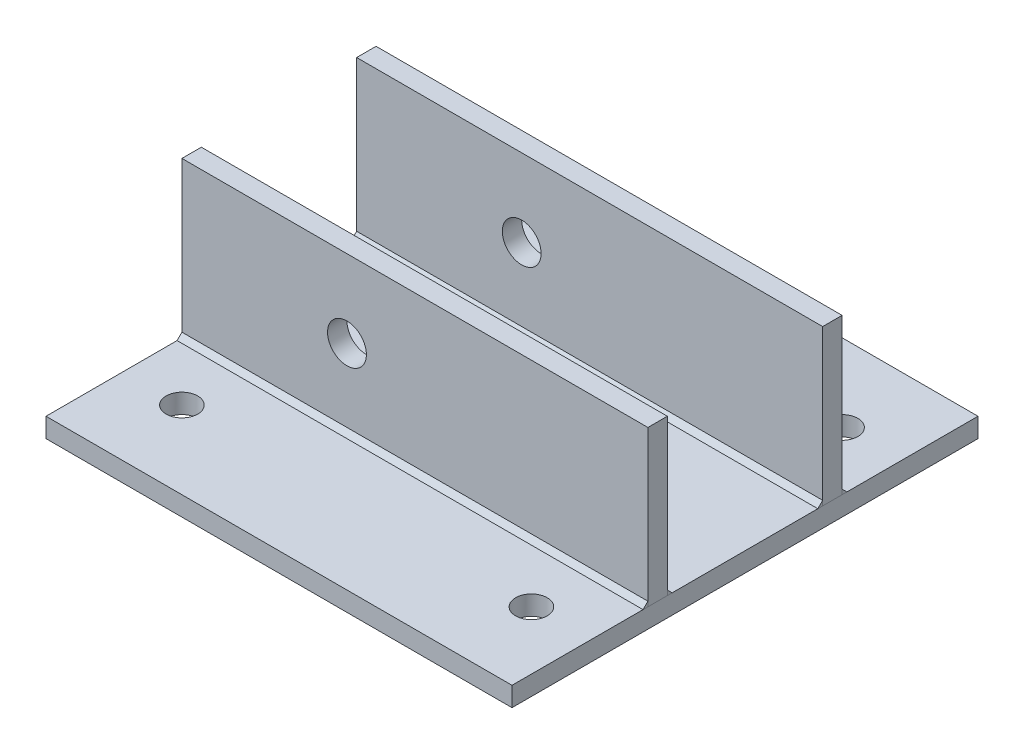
ISO-10303-21;
HEADER;
FILE_DESCRIPTION(('STEP AP214'),'2;1');
FILE_NAME('part.step','',(''),(''),'','','');
FILE_SCHEMA(('AUTOMOTIVE_DESIGN { 1 0 10303 214 1 1 1 1 }'));
ENDSEC;
DATA;
#1=APPLICATION_CONTEXT('core data for automotive mechanical design processes');
#2=APPLICATION_PROTOCOL_DEFINITION('international standard','automotive_design',2000,#1);
#3=PRODUCT_CONTEXT('',#1,'mechanical');
#4=PRODUCT('Part','Part','',(#3));
#5=PRODUCT_RELATED_PRODUCT_CATEGORY('part','',(#4));
#6=PRODUCT_DEFINITION_FORMATION('','',#4);
#7=PRODUCT_DEFINITION_CONTEXT('part definition',#1,'design');
#8=PRODUCT_DEFINITION('design','',#6,#7);
#9=PRODUCT_DEFINITION_SHAPE('','',#8);
#10=(LENGTH_UNIT() NAMED_UNIT(*) SI_UNIT(.MILLI.,.METRE.));
#11=(NAMED_UNIT(*) PLANE_ANGLE_UNIT() SI_UNIT($,.RADIAN.));
#12=(NAMED_UNIT(*) SI_UNIT($,.STERADIAN.) SOLID_ANGLE_UNIT());
#13=UNCERTAINTY_MEASURE_WITH_UNIT(LENGTH_MEASURE(1.E-05),#10,'distance_accuracy_value','');
#14=(GEOMETRIC_REPRESENTATION_CONTEXT(3) GLOBAL_UNCERTAINTY_ASSIGNED_CONTEXT((#13)) GLOBAL_UNIT_ASSIGNED_CONTEXT((#10,
#11,#12)) REPRESENTATION_CONTEXT('',''));
#15=CARTESIAN_POINT('',(0.,0.,0.));
#16=DIRECTION('',(0.,0.,1.));
#17=DIRECTION('',(1.,0.,0.));
#18=AXIS2_PLACEMENT_3D('',#15,#16,#17);
#19=CARTESIAN_POINT('',(0.,12.7,0.));
#20=DIRECTION('',(-1.,0.,0.));
#21=DIRECTION('',(0.,0.,1.));
#22=AXIS2_PLACEMENT_3D('',#19,#20,#21);
#23=PLANE('',#22);
#24=DIRECTION('',(0.,0.,-1.));
#25=VECTOR('',#24,1.);
#26=CARTESIAN_POINT('',(0.,12.7,304.8));
#27=LINE('',#26,#25);
#28=CARTESIAN_POINT('',(0.,12.7,203.2));
#29=VERTEX_POINT('',#28);
#30=CARTESIAN_POINT('',(0.,12.7,200.025));
#31=VERTEX_POINT('',#30);
#32=EDGE_CURVE('E48',#29,#31,#27,.T.);
#33=ORIENTED_EDGE('',*,*,#32,.T.);
#34=DIRECTION('',(0.,-0.707106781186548,-0.707106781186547));
#35=VECTOR('',#34,1.);
#36=CARTESIAN_POINT('',(0.,-87.3125,100.0125));
#37=LINE('',#36,#35);
#38=CARTESIAN_POINT('',(0.,15.875,203.2));
#39=VERTEX_POINT('',#38);
#40=EDGE_CURVE('E94',#31,#39,#37,.F.);
#41=ORIENTED_EDGE('',*,*,#40,.T.);
#42=DIRECTION('',(0.,-1.,0.));
#43=VECTOR('',#42,1.);
#44=CARTESIAN_POINT('',(0.,114.3,203.2));
#45=LINE('',#44,#43);
#46=EDGE_CURVE('E63',#39,#29,#45,.T.);
#47=ORIENTED_EDGE('',*,*,#46,.T.);
#48=EDGE_LOOP('',(#33,#41,#47));
#49=FACE_BOUND('',#48,.T.);
#50=ADVANCED_FACE('F44',(#49),#23,.F.);
#51=CARTESIAN_POINT('',(-304.8,12.7,0.));
#52=DIRECTION('',(1.,0.,0.));
#53=DIRECTION('',(0.,0.,-1.));
#54=AXIS2_PLACEMENT_3D('',#51,#52,#53);
#55=PLANE('',#54);
#56=DIRECTION('',(0.,0.,1.));
#57=VECTOR('',#56,1.);
#58=CARTESIAN_POINT('',(-304.8,12.7,304.8));
#59=LINE('',#58,#57);
#60=CARTESIAN_POINT('',(-304.8,12.7,200.025));
#61=VERTEX_POINT('',#60);
#62=CARTESIAN_POINT('',(-304.8,12.7,203.2));
#63=VERTEX_POINT('',#62);
#64=EDGE_CURVE('E81',#61,#63,#59,.T.);
#65=ORIENTED_EDGE('',*,*,#64,.T.);
#66=DIRECTION('',(0.,-1.,0.));
#67=VECTOR('',#66,1.);
#68=CARTESIAN_POINT('',(-304.8,114.3,203.2));
#69=LINE('',#68,#67);
#70=CARTESIAN_POINT('',(-304.8,15.875,203.2));
#71=VERTEX_POINT('',#70);
#72=EDGE_CURVE('E12',#71,#63,#69,.T.);
#73=ORIENTED_EDGE('',*,*,#72,.F.);
#74=DIRECTION('',(0.,0.707106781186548,0.707106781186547));
#75=VECTOR('',#74,1.);
#76=CARTESIAN_POINT('',(-304.8,-87.3125,100.0125));
#77=LINE('',#76,#75);
#78=EDGE_CURVE('E84',#71,#61,#77,.F.);
#79=ORIENTED_EDGE('',*,*,#78,.T.);
#80=EDGE_LOOP('',(#65,#73,#79));
#81=FACE_BOUND('',#80,.T.);
#82=ADVANCED_FACE('F82',(#81),#55,.F.);
#83=CARTESIAN_POINT('',(-304.8,15.875,203.2));
#84=DIRECTION('',(0.,0.707106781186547,-0.707106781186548));
#85=DIRECTION('',(0.,0.707106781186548,0.707106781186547));
#86=AXIS2_PLACEMENT_3D('',#83,#84,#85);
#87=PLANE('',#86);
#88=ORIENTED_EDGE('',*,*,#40,.F.);
#89=DIRECTION('',(1.,0.,0.));
#90=VECTOR('',#89,1.);
#91=CARTESIAN_POINT('',(0.,12.7,200.025));
#92=LINE('',#91,#90);
#93=EDGE_CURVE('E89',#61,#31,#92,.T.);
#94=ORIENTED_EDGE('',*,*,#93,.F.);
#95=ORIENTED_EDGE('',*,*,#78,.F.);
#96=DIRECTION('',(-1.,0.,0.));
#97=VECTOR('',#96,1.);
#98=CARTESIAN_POINT('',(-304.8,15.875,203.2));
#99=LINE('',#98,#97);
#100=EDGE_CURVE('E54',#39,#71,#99,.T.);
#101=ORIENTED_EDGE('',*,*,#100,.F.);
#102=EDGE_LOOP('',(#88,#94,#95,#101));
#103=FACE_BOUND('',#102,.T.);
#104=ADVANCED_FACE('F100',(#103),#87,.T.);
#105=CARTESIAN_POINT('',(0.,12.7,304.8));
#106=DIRECTION('',(0.,-1.,0.));
#107=DIRECTION('',(0.,0.,-1.));
#108=AXIS2_PLACEMENT_3D('',#105,#106,#107);
#109=PLANE('',#108);
#110=ORIENTED_EDGE('',*,*,#93,.T.);
#111=ORIENTED_EDGE('',*,*,#32,.F.);
#112=DIRECTION('',(-1.,0.,0.));
#113=VECTOR('',#112,1.);
#114=CARTESIAN_POINT('',(0.,12.7,203.2));
#115=LINE('',#114,#113);
#116=EDGE_CURVE('E87',#29,#63,#115,.T.);
#117=ORIENTED_EDGE('',*,*,#116,.T.);
#118=ORIENTED_EDGE('',*,*,#64,.F.);
#119=EDGE_LOOP('',(#110,#111,#117,#118));
#120=FACE_BOUND('',#119,.T.);
#121=ADVANCED_FACE('F46',(#120),#109,.T.);
#122=CARTESIAN_POINT('',(-304.8,114.3,203.2));
#123=DIRECTION('',(0.,0.,1.));
#124=DIRECTION('',(1.,0.,0.));
#125=AXIS2_PLACEMENT_3D('',#122,#123,#124);
#126=PLANE('',#125);
#127=ORIENTED_EDGE('',*,*,#100,.T.);
#128=ORIENTED_EDGE('',*,*,#72,.T.);
#129=ORIENTED_EDGE('',*,*,#116,.F.);
#130=ORIENTED_EDGE('',*,*,#46,.F.);
#131=EDGE_LOOP('',(#127,#128,#129,#130));
#132=FACE_BOUND('',#131,.T.);
#133=ADVANCED_FACE('F86',(#132),#126,.T.);
#134=CLOSED_SHELL('',(#50,#82,#104,#121,#133));
#135=MANIFOLD_SOLID_BREP('B2',#134);
#136=CARTESIAN_POINT('',(-304.8,15.875,215.9));
#137=DIRECTION('',(0.,0.707106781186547,0.707106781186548));
#138=DIRECTION('',(0.,-0.707106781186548,0.707106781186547));
#139=AXIS2_PLACEMENT_3D('',#136,#137,#138);
#140=PLANE('',#139);
#141=DIRECTION('',(0.,-0.707106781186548,0.707106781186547));
#142=VECTOR('',#141,1.);
#143=CARTESIAN_POINT('',(-304.8,122.2375,109.5375));
#144=LINE('',#143,#142);
#145=CARTESIAN_POINT('',(-304.8,12.7,219.075));
#146=VERTEX_POINT('',#145);
#147=CARTESIAN_POINT('',(-304.8,15.875,215.9));
#148=VERTEX_POINT('',#147);
#149=EDGE_CURVE('E42',#146,#148,#144,.F.);
#150=ORIENTED_EDGE('',*,*,#149,.F.);
#151=DIRECTION('',(-1.,0.,0.));
#152=VECTOR('',#151,1.);
#153=CARTESIAN_POINT('',(-304.8,12.7,219.075));
#154=LINE('',#153,#152);
#155=CARTESIAN_POINT('',(0.,12.7,219.075));
#156=VERTEX_POINT('',#155);
#157=EDGE_CURVE('E200',#156,#146,#154,.T.);
#158=ORIENTED_EDGE('',*,*,#157,.F.);
#159=DIRECTION('',(0.,0.707106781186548,-0.707106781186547));
#160=VECTOR('',#159,1.);
#161=CARTESIAN_POINT('',(0.,122.2375,109.5375));
#162=LINE('',#161,#160);
#163=CARTESIAN_POINT('',(0.,15.875,215.9));
#164=VERTEX_POINT('',#163);
#165=EDGE_CURVE('E159',#164,#156,#162,.F.);
#166=ORIENTED_EDGE('',*,*,#165,.F.);
#167=DIRECTION('',(1.,0.,0.));
#168=VECTOR('',#167,1.);
#169=CARTESIAN_POINT('',(0.,15.875,215.9));
#170=LINE('',#169,#168);
#171=EDGE_CURVE('E198',#148,#164,#170,.T.);
#172=ORIENTED_EDGE('',*,*,#171,.F.);
#173=EDGE_LOOP('',(#150,#158,#166,#172));
#174=FACE_BOUND('',#173,.T.);
#175=ADVANCED_FACE('F152',(#174),#140,.T.);
#176=CARTESIAN_POINT('',(-304.8,12.7,0.));
#177=DIRECTION('',(1.,0.,0.));
#178=DIRECTION('',(0.,0.,-1.));
#179=AXIS2_PLACEMENT_3D('',#176,#177,#178);
#180=PLANE('',#179);
#181=DIRECTION('',(0.,0.,1.));
#182=VECTOR('',#181,1.);
#183=CARTESIAN_POINT('',(-304.8,12.7,304.8));
#184=LINE('',#183,#182);
#185=CARTESIAN_POINT('',(-304.8,12.7,215.9));
#186=VERTEX_POINT('',#185);
#187=EDGE_CURVE('E190',#186,#146,#184,.T.);
#188=ORIENTED_EDGE('',*,*,#187,.T.);
#189=ORIENTED_EDGE('',*,*,#149,.T.);
#190=DIRECTION('',(0.,-1.,0.));
#191=VECTOR('',#190,1.);
#192=CARTESIAN_POINT('',(-304.8,114.3,215.9));
#193=LINE('',#192,#191);
#194=EDGE_CURVE('E166',#148,#186,#193,.T.);
#195=ORIENTED_EDGE('',*,*,#194,.T.);
#196=EDGE_LOOP('',(#188,#189,#195));
#197=FACE_BOUND('',#196,.T.);
#198=ADVANCED_FACE('F208',(#197),#180,.F.);
#199=CARTESIAN_POINT('',(0.,12.7,0.));
#200=DIRECTION('',(-1.,0.,0.));
#201=DIRECTION('',(0.,0.,1.));
#202=AXIS2_PLACEMENT_3D('',#199,#200,#201);
#203=PLANE('',#202);
#204=DIRECTION('',(0.,0.,-1.));
#205=VECTOR('',#204,1.);
#206=CARTESIAN_POINT('',(0.,12.7,304.8));
#207=LINE('',#206,#205);
#208=CARTESIAN_POINT('',(0.,12.7,215.9));
#209=VERTEX_POINT('',#208);
#210=EDGE_CURVE('E173',#156,#209,#207,.T.);
#211=ORIENTED_EDGE('',*,*,#210,.T.);
#212=DIRECTION('',(0.,-1.,0.));
#213=VECTOR('',#212,1.);
#214=CARTESIAN_POINT('',(0.,12.7,215.9));
#215=LINE('',#214,#213);
#216=EDGE_CURVE('E187',#164,#209,#215,.T.);
#217=ORIENTED_EDGE('',*,*,#216,.F.);
#218=ORIENTED_EDGE('',*,*,#165,.T.);
#219=EDGE_LOOP('',(#211,#217,#218));
#220=FACE_BOUND('',#219,.T.);
#221=ADVANCED_FACE('F185',(#220),#203,.F.);
#222=CARTESIAN_POINT('',(-304.8,114.3,215.9));
#223=DIRECTION('',(0.,0.,-1.));
#224=DIRECTION('',(-1.,0.,0.));
#225=AXIS2_PLACEMENT_3D('',#222,#223,#224);
#226=PLANE('',#225);
#227=ORIENTED_EDGE('',*,*,#171,.T.);
#228=ORIENTED_EDGE('',*,*,#216,.T.);
#229=DIRECTION('',(1.,0.,0.));
#230=VECTOR('',#229,1.);
#231=CARTESIAN_POINT('',(0.,12.7,215.9));
#232=LINE('',#231,#230);
#233=EDGE_CURVE('E192',#186,#209,#232,.T.);
#234=ORIENTED_EDGE('',*,*,#233,.F.);
#235=ORIENTED_EDGE('',*,*,#194,.F.);
#236=EDGE_LOOP('',(#227,#228,#234,#235));
#237=FACE_BOUND('',#236,.T.);
#238=ADVANCED_FACE('F196',(#237),#226,.T.);
#239=CARTESIAN_POINT('',(0.,12.7,304.8));
#240=DIRECTION('',(0.,-1.,0.));
#241=DIRECTION('',(0.,0.,-1.));
#242=AXIS2_PLACEMENT_3D('',#239,#240,#241);
#243=PLANE('',#242);
#244=ORIENTED_EDGE('',*,*,#157,.T.);
#245=ORIENTED_EDGE('',*,*,#187,.F.);
#246=ORIENTED_EDGE('',*,*,#233,.T.);
#247=ORIENTED_EDGE('',*,*,#210,.F.);
#248=EDGE_LOOP('',(#244,#245,#246,#247));
#249=FACE_BOUND('',#248,.T.);
#250=ADVANCED_FACE('F193',(#249),#243,.T.);
#251=CLOSED_SHELL('',(#175,#198,#221,#238,#250));
#252=MANIFOLD_SOLID_BREP('B6',#251);
#253=CARTESIAN_POINT('',(0.,12.7,0.));
#254=DIRECTION('',(-1.,0.,0.));
#255=DIRECTION('',(0.,0.,1.));
#256=AXIS2_PLACEMENT_3D('',#253,#254,#255);
#257=PLANE('',#256);
#258=DIRECTION('',(0.,0.,-1.));
#259=VECTOR('',#258,1.);
#260=CARTESIAN_POINT('',(0.,12.7,304.8));
#261=LINE('',#260,#259);
#262=CARTESIAN_POINT('',(0.,12.7,88.9));
#263=VERTEX_POINT('',#262);
#264=CARTESIAN_POINT('',(0.,12.7,85.725));
#265=VERTEX_POINT('',#264);
#266=EDGE_CURVE('E264',#263,#265,#261,.T.);
#267=ORIENTED_EDGE('',*,*,#266,.T.);
#268=DIRECTION('',(0.,-0.707106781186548,-0.707106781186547));
#269=VECTOR('',#268,1.);
#270=CARTESIAN_POINT('',(0.,-30.1625,42.8625));
#271=LINE('',#270,#269);
#272=CARTESIAN_POINT('',(0.,15.875,88.9));
#273=VERTEX_POINT('',#272);
#274=EDGE_CURVE('E310',#265,#273,#271,.F.);
#275=ORIENTED_EDGE('',*,*,#274,.T.);
#276=DIRECTION('',(0.,-1.,0.));
#277=VECTOR('',#276,1.);
#278=CARTESIAN_POINT('',(0.,114.3,88.9));
#279=LINE('',#278,#277);
#280=EDGE_CURVE('E279',#273,#263,#279,.T.);
#281=ORIENTED_EDGE('',*,*,#280,.T.);
#282=EDGE_LOOP('',(#267,#275,#281));
#283=FACE_BOUND('',#282,.T.);
#284=ADVANCED_FACE('F260',(#283),#257,.F.);
#285=CARTESIAN_POINT('',(-304.8,12.7,0.));
#286=DIRECTION('',(1.,0.,0.));
#287=DIRECTION('',(0.,0.,-1.));
#288=AXIS2_PLACEMENT_3D('',#285,#286,#287);
#289=PLANE('',#288);
#290=DIRECTION('',(0.,0.,1.));
#291=VECTOR('',#290,1.);
#292=CARTESIAN_POINT('',(-304.8,12.7,304.8));
#293=LINE('',#292,#291);
#294=CARTESIAN_POINT('',(-304.8,12.7,85.725));
#295=VERTEX_POINT('',#294);
#296=CARTESIAN_POINT('',(-304.8,12.7,88.9));
#297=VERTEX_POINT('',#296);
#298=EDGE_CURVE('E297',#295,#297,#293,.T.);
#299=ORIENTED_EDGE('',*,*,#298,.T.);
#300=DIRECTION('',(0.,-1.,0.));
#301=VECTOR('',#300,1.);
#302=CARTESIAN_POINT('',(-304.8,114.3,88.9));
#303=LINE('',#302,#301);
#304=CARTESIAN_POINT('',(-304.8,15.875,88.9));
#305=VERTEX_POINT('',#304);
#306=EDGE_CURVE('E150',#305,#297,#303,.T.);
#307=ORIENTED_EDGE('',*,*,#306,.F.);
#308=DIRECTION('',(0.,0.707106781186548,0.707106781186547));
#309=VECTOR('',#308,1.);
#310=CARTESIAN_POINT('',(-304.8,-30.1625,42.8625));
#311=LINE('',#310,#309);
#312=EDGE_CURVE('E300',#305,#295,#311,.F.);
#313=ORIENTED_EDGE('',*,*,#312,.T.);
#314=EDGE_LOOP('',(#299,#307,#313));
#315=FACE_BOUND('',#314,.T.);
#316=ADVANCED_FACE('F298',(#315),#289,.F.);
#317=CARTESIAN_POINT('',(-304.8,15.875,88.9));
#318=DIRECTION('',(0.,0.707106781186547,-0.707106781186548));
#319=DIRECTION('',(0.,0.707106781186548,0.707106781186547));
#320=AXIS2_PLACEMENT_3D('',#317,#318,#319);
#321=PLANE('',#320);
#322=ORIENTED_EDGE('',*,*,#274,.F.);
#323=DIRECTION('',(1.,0.,0.));
#324=VECTOR('',#323,1.);
#325=CARTESIAN_POINT('',(0.,12.7,85.725));
#326=LINE('',#325,#324);
#327=EDGE_CURVE('E305',#295,#265,#326,.T.);
#328=ORIENTED_EDGE('',*,*,#327,.F.);
#329=ORIENTED_EDGE('',*,*,#312,.F.);
#330=DIRECTION('',(-1.,0.,0.));
#331=VECTOR('',#330,1.);
#332=CARTESIAN_POINT('',(-304.8,15.875,88.9));
#333=LINE('',#332,#331);
#334=EDGE_CURVE('E270',#273,#305,#333,.T.);
#335=ORIENTED_EDGE('',*,*,#334,.F.);
#336=EDGE_LOOP('',(#322,#328,#329,#335));
#337=FACE_BOUND('',#336,.T.);
#338=ADVANCED_FACE('F316',(#337),#321,.T.);
#339=CARTESIAN_POINT('',(0.,12.7,304.8));
#340=DIRECTION('',(0.,-1.,0.));
#341=DIRECTION('',(0.,0.,-1.));
#342=AXIS2_PLACEMENT_3D('',#339,#340,#341);
#343=PLANE('',#342);
#344=ORIENTED_EDGE('',*,*,#327,.T.);
#345=ORIENTED_EDGE('',*,*,#266,.F.);
#346=DIRECTION('',(-1.,0.,0.));
#347=VECTOR('',#346,1.);
#348=CARTESIAN_POINT('',(0.,12.7,88.9));
#349=LINE('',#348,#347);
#350=EDGE_CURVE('E303',#263,#297,#349,.T.);
#351=ORIENTED_EDGE('',*,*,#350,.T.);
#352=ORIENTED_EDGE('',*,*,#298,.F.);
#353=EDGE_LOOP('',(#344,#345,#351,#352));
#354=FACE_BOUND('',#353,.T.);
#355=ADVANCED_FACE('F262',(#354),#343,.T.);
#356=CARTESIAN_POINT('',(-304.8,114.3,88.9));
#357=DIRECTION('',(0.,0.,1.));
#358=DIRECTION('',(1.,0.,0.));
#359=AXIS2_PLACEMENT_3D('',#356,#357,#358);
#360=PLANE('',#359);
#361=ORIENTED_EDGE('',*,*,#334,.T.);
#362=ORIENTED_EDGE('',*,*,#306,.T.);
#363=ORIENTED_EDGE('',*,*,#350,.F.);
#364=ORIENTED_EDGE('',*,*,#280,.F.);
#365=EDGE_LOOP('',(#361,#362,#363,#364));
#366=FACE_BOUND('',#365,.T.);
#367=ADVANCED_FACE('F302',(#366),#360,.T.);
#368=CLOSED_SHELL('',(#284,#316,#338,#355,#367));
#369=MANIFOLD_SOLID_BREP('B36',#368);
#370=CARTESIAN_POINT('',(-304.8,15.875,101.6));
#371=DIRECTION('',(0.,0.707106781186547,0.707106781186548));
#372=DIRECTION('',(0.,-0.707106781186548,0.707106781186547));
#373=AXIS2_PLACEMENT_3D('',#370,#371,#372);
#374=PLANE('',#373);
#375=DIRECTION('',(0.,-0.707106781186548,0.707106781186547));
#376=VECTOR('',#375,1.);
#377=CARTESIAN_POINT('',(-304.8,65.0875,52.3875));
#378=LINE('',#377,#376);
#379=CARTESIAN_POINT('',(-304.8,12.7,104.775));
#380=VERTEX_POINT('',#379);
#381=CARTESIAN_POINT('',(-304.8,15.875,101.6));
#382=VERTEX_POINT('',#381);
#383=EDGE_CURVE('E258',#380,#382,#378,.F.);
#384=ORIENTED_EDGE('',*,*,#383,.F.);
#385=DIRECTION('',(-1.,0.,0.));
#386=VECTOR('',#385,1.);
#387=CARTESIAN_POINT('',(-304.8,12.7,104.775));
#388=LINE('',#387,#386);
#389=CARTESIAN_POINT('',(0.,12.7,104.775));
#390=VERTEX_POINT('',#389);
#391=EDGE_CURVE('E416',#390,#380,#388,.T.);
#392=ORIENTED_EDGE('',*,*,#391,.F.);
#393=DIRECTION('',(0.,0.707106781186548,-0.707106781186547));
#394=VECTOR('',#393,1.);
#395=CARTESIAN_POINT('',(0.,65.0875,52.3875));
#396=LINE('',#395,#394);
#397=CARTESIAN_POINT('',(0.,15.875,101.6));
#398=VERTEX_POINT('',#397);
#399=EDGE_CURVE('E375',#398,#390,#396,.F.);
#400=ORIENTED_EDGE('',*,*,#399,.F.);
#401=DIRECTION('',(1.,0.,0.));
#402=VECTOR('',#401,1.);
#403=CARTESIAN_POINT('',(0.,15.875,101.6));
#404=LINE('',#403,#402);
#405=EDGE_CURVE('E414',#382,#398,#404,.T.);
#406=ORIENTED_EDGE('',*,*,#405,.F.);
#407=EDGE_LOOP('',(#384,#392,#400,#406));
#408=FACE_BOUND('',#407,.T.);
#409=ADVANCED_FACE('F368',(#408),#374,.T.);
#410=CARTESIAN_POINT('',(-304.8,12.7,0.));
#411=DIRECTION('',(1.,0.,0.));
#412=DIRECTION('',(0.,0.,-1.));
#413=AXIS2_PLACEMENT_3D('',#410,#411,#412);
#414=PLANE('',#413);
#415=DIRECTION('',(0.,0.,1.));
#416=VECTOR('',#415,1.);
#417=CARTESIAN_POINT('',(-304.8,12.7,304.8));
#418=LINE('',#417,#416);
#419=CARTESIAN_POINT('',(-304.8,12.7,101.6));
#420=VERTEX_POINT('',#419);
#421=EDGE_CURVE('E406',#420,#380,#418,.T.);
#422=ORIENTED_EDGE('',*,*,#421,.T.);
#423=ORIENTED_EDGE('',*,*,#383,.T.);
#424=DIRECTION('',(0.,-1.,0.));
#425=VECTOR('',#424,1.);
#426=CARTESIAN_POINT('',(-304.8,114.3,101.6));
#427=LINE('',#426,#425);
#428=EDGE_CURVE('E382',#382,#420,#427,.T.);
#429=ORIENTED_EDGE('',*,*,#428,.T.);
#430=EDGE_LOOP('',(#422,#423,#429));
#431=FACE_BOUND('',#430,.T.);
#432=ADVANCED_FACE('F424',(#431),#414,.F.);
#433=CARTESIAN_POINT('',(0.,12.7,0.));
#434=DIRECTION('',(-1.,0.,0.));
#435=DIRECTION('',(0.,0.,1.));
#436=AXIS2_PLACEMENT_3D('',#433,#434,#435);
#437=PLANE('',#436);
#438=DIRECTION('',(0.,0.,-1.));
#439=VECTOR('',#438,1.);
#440=CARTESIAN_POINT('',(0.,12.7,304.8));
#441=LINE('',#440,#439);
#442=CARTESIAN_POINT('',(0.,12.7,101.6));
#443=VERTEX_POINT('',#442);
#444=EDGE_CURVE('E389',#390,#443,#441,.T.);
#445=ORIENTED_EDGE('',*,*,#444,.T.);
#446=DIRECTION('',(0.,-1.,0.));
#447=VECTOR('',#446,1.);
#448=CARTESIAN_POINT('',(0.,12.7,101.6));
#449=LINE('',#448,#447);
#450=EDGE_CURVE('E403',#398,#443,#449,.T.);
#451=ORIENTED_EDGE('',*,*,#450,.F.);
#452=ORIENTED_EDGE('',*,*,#399,.T.);
#453=EDGE_LOOP('',(#445,#451,#452));
#454=FACE_BOUND('',#453,.T.);
#455=ADVANCED_FACE('F401',(#454),#437,.F.);
#456=CARTESIAN_POINT('',(-304.8,114.3,101.6));
#457=DIRECTION('',(0.,0.,-1.));
#458=DIRECTION('',(-1.,0.,0.));
#459=AXIS2_PLACEMENT_3D('',#456,#457,#458);
#460=PLANE('',#459);
#461=ORIENTED_EDGE('',*,*,#405,.T.);
#462=ORIENTED_EDGE('',*,*,#450,.T.);
#463=DIRECTION('',(1.,0.,0.));
#464=VECTOR('',#463,1.);
#465=CARTESIAN_POINT('',(0.,12.7,101.6));
#466=LINE('',#465,#464);
#467=EDGE_CURVE('E408',#420,#443,#466,.T.);
#468=ORIENTED_EDGE('',*,*,#467,.F.);
#469=ORIENTED_EDGE('',*,*,#428,.F.);
#470=EDGE_LOOP('',(#461,#462,#468,#469));
#471=FACE_BOUND('',#470,.T.);
#472=ADVANCED_FACE('F412',(#471),#460,.T.);
#473=CARTESIAN_POINT('',(0.,12.7,304.8));
#474=DIRECTION('',(0.,-1.,0.));
#475=DIRECTION('',(0.,0.,-1.));
#476=AXIS2_PLACEMENT_3D('',#473,#474,#475);
#477=PLANE('',#476);
#478=ORIENTED_EDGE('',*,*,#391,.T.);
#479=ORIENTED_EDGE('',*,*,#421,.F.);
#480=ORIENTED_EDGE('',*,*,#467,.T.);
#481=ORIENTED_EDGE('',*,*,#444,.F.);
#482=EDGE_LOOP('',(#478,#479,#480,#481));
#483=FACE_BOUND('',#482,.T.);
#484=ADVANCED_FACE('F409',(#483),#477,.T.);
#485=CLOSED_SHELL('',(#409,#432,#455,#472,#484));
#486=MANIFOLD_SOLID_BREP('B144',#485);
#487=CARTESIAN_POINT('',(-304.8,114.3,203.2));
#488=DIRECTION('',(1.,0.,0.));
#489=DIRECTION('',(0.,0.,-1.));
#490=AXIS2_PLACEMENT_3D('',#487,#488,#489);
#491=PLANE('',#490);
#492=DIRECTION('',(0.,0.,1.));
#493=VECTOR('',#492,1.);
#494=CARTESIAN_POINT('',(-304.8,12.7,203.2));
#495=LINE('',#494,#493);
#496=CARTESIAN_POINT('',(-304.8,12.7,203.2));
#497=VERTEX_POINT('',#496);
#498=CARTESIAN_POINT('',(-304.8,12.7,215.9));
#499=VERTEX_POINT('',#498);
#500=EDGE_CURVE('E541',#497,#499,#495,.T.);
#501=ORIENTED_EDGE('',*,*,#500,.T.);
#502=DIRECTION('',(0.,-1.,0.));
#503=VECTOR('',#502,1.);
#504=CARTESIAN_POINT('',(-304.8,114.3,215.9));
#505=LINE('',#504,#503);
#506=CARTESIAN_POINT('',(-304.8,114.3,215.9));
#507=VERTEX_POINT('',#506);
#508=EDGE_CURVE('E366',#507,#499,#505,.T.);
#509=ORIENTED_EDGE('',*,*,#508,.F.);
#510=DIRECTION('',(0.,0.,1.));
#511=VECTOR('',#510,1.);
#512=CARTESIAN_POINT('',(-304.8,114.3,203.2));
#513=LINE('',#512,#511);
#514=CARTESIAN_POINT('',(-304.8,114.3,203.2));
#515=VERTEX_POINT('',#514);
#516=EDGE_CURVE('E528',#515,#507,#513,.T.);
#517=ORIENTED_EDGE('',*,*,#516,.F.);
#518=DIRECTION('',(0.,-1.,0.));
#519=VECTOR('',#518,1.);
#520=CARTESIAN_POINT('',(-304.8,114.3,203.2));
#521=LINE('',#520,#519);
#522=EDGE_CURVE('E537',#515,#497,#521,.T.);
#523=ORIENTED_EDGE('',*,*,#522,.T.);
#524=EDGE_LOOP('',(#501,#509,#517,#523));
#525=FACE_BOUND('',#524,.T.);
#526=ADVANCED_FACE('F476',(#525),#491,.F.);
#527=CARTESIAN_POINT('',(-304.8,114.3,215.9));
#528=DIRECTION('',(0.,0.,-1.));
#529=DIRECTION('',(-1.,0.,0.));
#530=AXIS2_PLACEMENT_3D('',#527,#528,#529);
#531=PLANE('',#530);
#532=CARTESIAN_POINT('',(-196.85,63.5,215.9));
#533=DIRECTION('',(0.,0.,1.));
#534=DIRECTION('',(1.,0.,0.));
#535=AXIS2_PLACEMENT_3D('',#532,#533,#534);
#536=CIRCLE('',#535,12.7);
#537=CARTESIAN_POINT('',(-184.15,63.5,215.9));
#538=VERTEX_POINT('',#537);
#539=EDGE_CURVE('E554',#538,#538,#536,.T.);
#540=ORIENTED_EDGE('',*,*,#539,.F.);
#541=EDGE_LOOP('',(#540));
#542=FACE_BOUND('',#541,.T.);
#543=DIRECTION('',(1.,0.,0.));
#544=VECTOR('',#543,1.);
#545=CARTESIAN_POINT('',(-304.8,12.7,215.9));
#546=LINE('',#545,#544);
#547=CARTESIAN_POINT('',(0.,12.7,215.9));
#548=VERTEX_POINT('',#547);
#549=EDGE_CURVE('E532',#499,#548,#546,.T.);
#550=ORIENTED_EDGE('',*,*,#549,.T.);
#551=DIRECTION('',(0.,-1.,0.));
#552=VECTOR('',#551,1.);
#553=CARTESIAN_POINT('',(0.,114.3,215.9));
#554=LINE('',#553,#552);
#555=CARTESIAN_POINT('',(0.,114.3,215.9));
#556=VERTEX_POINT('',#555);
#557=EDGE_CURVE('E485',#556,#548,#554,.T.);
#558=ORIENTED_EDGE('',*,*,#557,.F.);
#559=DIRECTION('',(1.,0.,0.));
#560=VECTOR('',#559,1.);
#561=CARTESIAN_POINT('',(-304.8,114.3,215.9));
#562=LINE('',#561,#560);
#563=EDGE_CURVE('E523',#507,#556,#562,.T.);
#564=ORIENTED_EDGE('',*,*,#563,.F.);
#565=ORIENTED_EDGE('',*,*,#508,.T.);
#566=EDGE_LOOP('',(#550,#558,#564,#565));
#567=FACE_BOUND('',#566,.T.);
#568=ADVANCED_FACE('F531',(#542,#567),#531,.F.);
#569=CARTESIAN_POINT('',(0.,114.3,203.2));
#570=DIRECTION('',(-1.,0.,0.));
#571=DIRECTION('',(0.,0.,1.));
#572=AXIS2_PLACEMENT_3D('',#569,#570,#571);
#573=PLANE('',#572);
#574=DIRECTION('',(0.,0.,-1.));
#575=VECTOR('',#574,1.);
#576=CARTESIAN_POINT('',(0.,12.7,203.2));
#577=LINE('',#576,#575);
#578=CARTESIAN_POINT('',(0.,12.7,203.2));
#579=VERTEX_POINT('',#578);
#580=EDGE_CURVE('E510',#548,#579,#577,.T.);
#581=ORIENTED_EDGE('',*,*,#580,.T.);
#582=DIRECTION('',(0.,-1.,0.));
#583=VECTOR('',#582,1.);
#584=CARTESIAN_POINT('',(0.,114.3,203.2));
#585=LINE('',#584,#583);
#586=CARTESIAN_POINT('',(0.,114.3,203.2));
#587=VERTEX_POINT('',#586);
#588=EDGE_CURVE('E533',#587,#579,#585,.T.);
#589=ORIENTED_EDGE('',*,*,#588,.F.);
#590=DIRECTION('',(0.,0.,-1.));
#591=VECTOR('',#590,1.);
#592=CARTESIAN_POINT('',(0.,114.3,203.2));
#593=LINE('',#592,#591);
#594=EDGE_CURVE('E526',#556,#587,#593,.T.);
#595=ORIENTED_EDGE('',*,*,#594,.F.);
#596=ORIENTED_EDGE('',*,*,#557,.T.);
#597=EDGE_LOOP('',(#581,#589,#595,#596));
#598=FACE_BOUND('',#597,.T.);
#599=ADVANCED_FACE('F535',(#598),#573,.F.);
#600=CARTESIAN_POINT('',(-304.8,114.3,203.2));
#601=DIRECTION('',(0.,0.,1.));
#602=DIRECTION('',(1.,0.,0.));
#603=AXIS2_PLACEMENT_3D('',#600,#601,#602);
#604=PLANE('',#603);
#605=CARTESIAN_POINT('',(-196.85,63.5,203.2));
#606=DIRECTION('',(0.,0.,1.));
#607=DIRECTION('',(1.,0.,0.));
#608=AXIS2_PLACEMENT_3D('',#605,#606,#607);
#609=CIRCLE('',#608,12.7);
#610=CARTESIAN_POINT('',(-184.15,63.5,203.2));
#611=VERTEX_POINT('',#610);
#612=EDGE_CURVE('E479',#611,#611,#609,.T.);
#613=ORIENTED_EDGE('',*,*,#612,.T.);
#614=EDGE_LOOP('',(#613));
#615=FACE_BOUND('',#614,.T.);
#616=DIRECTION('',(-1.,0.,0.));
#617=VECTOR('',#616,1.);
#618=CARTESIAN_POINT('',(-304.8,12.7,203.2));
#619=LINE('',#618,#617);
#620=EDGE_CURVE('E516',#579,#497,#619,.T.);
#621=ORIENTED_EDGE('',*,*,#620,.T.);
#622=ORIENTED_EDGE('',*,*,#522,.F.);
#623=DIRECTION('',(-1.,0.,0.));
#624=VECTOR('',#623,1.);
#625=CARTESIAN_POINT('',(-304.8,114.3,203.2));
#626=LINE('',#625,#624);
#627=EDGE_CURVE('E493',#587,#515,#626,.T.);
#628=ORIENTED_EDGE('',*,*,#627,.F.);
#629=ORIENTED_EDGE('',*,*,#588,.T.);
#630=EDGE_LOOP('',(#621,#622,#628,#629));
#631=FACE_BOUND('',#630,.T.);
#632=ADVANCED_FACE('F548',(#615,#631),#604,.F.);
#633=CARTESIAN_POINT('',(-304.8,114.3,215.9));
#634=DIRECTION('',(0.,1.,0.));
#635=DIRECTION('',(0.,0.,1.));
#636=AXIS2_PLACEMENT_3D('',#633,#634,#635);
#637=PLANE('',#636);
#638=ORIENTED_EDGE('',*,*,#516,.T.);
#639=ORIENTED_EDGE('',*,*,#563,.T.);
#640=ORIENTED_EDGE('',*,*,#594,.T.);
#641=ORIENTED_EDGE('',*,*,#627,.T.);
#642=EDGE_LOOP('',(#638,#639,#640,#641));
#643=FACE_BOUND('',#642,.T.);
#644=ADVANCED_FACE('F524',(#643),#637,.T.);
#645=CARTESIAN_POINT('',(-304.8,12.7,215.9));
#646=DIRECTION('',(0.,1.,0.));
#647=DIRECTION('',(0.,0.,1.));
#648=AXIS2_PLACEMENT_3D('',#645,#646,#647);
#649=PLANE('',#648);
#650=ORIENTED_EDGE('',*,*,#500,.F.);
#651=ORIENTED_EDGE('',*,*,#620,.F.);
#652=ORIENTED_EDGE('',*,*,#580,.F.);
#653=ORIENTED_EDGE('',*,*,#549,.F.);
#654=EDGE_LOOP('',(#650,#651,#652,#653));
#655=FACE_BOUND('',#654,.T.);
#656=ADVANCED_FACE('F551',(#655),#649,.F.);
#657=CARTESIAN_POINT('',(-196.85,63.5,52.9789755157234));
#658=DIRECTION('',(0.,0.,1.));
#659=DIRECTION('',(1.,0.,0.));
#660=AXIS2_PLACEMENT_3D('',#657,#658,#659);
#661=CYLINDRICAL_SURFACE('',#660,12.7);
#662=ORIENTED_EDGE('',*,*,#539,.T.);
#663=EDGE_LOOP('',(#662));
#664=FACE_BOUND('',#663,.T.);
#665=ORIENTED_EDGE('',*,*,#612,.F.);
#666=EDGE_LOOP('',(#665));
#667=FACE_BOUND('',#666,.T.);
#668=ADVANCED_FACE('F562',(#664,#667),#661,.F.);
#669=CLOSED_SHELL('',(#526,#568,#599,#632,#644,#656,#668));
#670=MANIFOLD_SOLID_BREP('B252',#669);
#671=CARTESIAN_POINT('',(-304.8,114.3,101.6));
#672=DIRECTION('',(1.,0.,0.));
#673=DIRECTION('',(0.,0.,-1.));
#674=AXIS2_PLACEMENT_3D('',#671,#672,#673);
#675=PLANE('',#674);
#676=DIRECTION('',(0.,0.,1.));
#677=VECTOR('',#676,1.);
#678=CARTESIAN_POINT('',(-304.8,12.7,101.6));
#679=LINE('',#678,#677);
#680=CARTESIAN_POINT('',(-304.8,12.7,88.9));
#681=VERTEX_POINT('',#680);
#682=CARTESIAN_POINT('',(-304.8,12.7,101.6));
#683=VERTEX_POINT('',#682);
#684=EDGE_CURVE('E693',#681,#683,#679,.T.);
#685=ORIENTED_EDGE('',*,*,#684,.T.);
#686=DIRECTION('',(0.,-1.,0.));
#687=VECTOR('',#686,1.);
#688=CARTESIAN_POINT('',(-304.8,114.3,101.6));
#689=LINE('',#688,#687);
#690=CARTESIAN_POINT('',(-304.8,114.3,101.6));
#691=VERTEX_POINT('',#690);
#692=EDGE_CURVE('E474',#691,#683,#689,.T.);
#693=ORIENTED_EDGE('',*,*,#692,.F.);
#694=DIRECTION('',(0.,0.,1.));
#695=VECTOR('',#694,1.);
#696=CARTESIAN_POINT('',(-304.8,114.3,101.6));
#697=LINE('',#696,#695);
#698=CARTESIAN_POINT('',(-304.8,114.3,88.9));
#699=VERTEX_POINT('',#698);
#700=EDGE_CURVE('E681',#699,#691,#697,.T.);
#701=ORIENTED_EDGE('',*,*,#700,.F.);
#702=DIRECTION('',(0.,-1.,0.));
#703=VECTOR('',#702,1.);
#704=CARTESIAN_POINT('',(-304.8,114.3,88.9));
#705=LINE('',#704,#703);
#706=EDGE_CURVE('E689',#699,#681,#705,.T.);
#707=ORIENTED_EDGE('',*,*,#706,.T.);
#708=EDGE_LOOP('',(#685,#693,#701,#707));
#709=FACE_BOUND('',#708,.T.);
#710=ADVANCED_FACE('F630',(#709),#675,.F.);
#711=CARTESIAN_POINT('',(-304.8,114.3,101.6));
#712=DIRECTION('',(0.,0.,-1.));
#713=DIRECTION('',(-1.,0.,0.));
#714=AXIS2_PLACEMENT_3D('',#711,#712,#713);
#715=PLANE('',#714);
#716=CARTESIAN_POINT('',(-196.85,63.5,101.6));
#717=DIRECTION('',(0.,0.,-1.));
#718=DIRECTION('',(-1.,0.,0.));
#719=AXIS2_PLACEMENT_3D('',#716,#717,#718);
#720=CIRCLE('',#719,12.7);
#721=CARTESIAN_POINT('',(-209.55,63.5,101.6));
#722=VERTEX_POINT('',#721);
#723=EDGE_CURVE('E696',#722,#722,#720,.T.);
#724=ORIENTED_EDGE('',*,*,#723,.T.);
#725=EDGE_LOOP('',(#724));
#726=FACE_BOUND('',#725,.T.);
#727=DIRECTION('',(1.,0.,0.));
#728=VECTOR('',#727,1.);
#729=CARTESIAN_POINT('',(-304.8,12.7,101.6));
#730=LINE('',#729,#728);
#731=CARTESIAN_POINT('',(0.,12.7,101.6));
#732=VERTEX_POINT('',#731);
#733=EDGE_CURVE('E685',#683,#732,#730,.T.);
#734=ORIENTED_EDGE('',*,*,#733,.T.);
#735=DIRECTION('',(0.,-1.,0.));
#736=VECTOR('',#735,1.);
#737=CARTESIAN_POINT('',(0.,114.3,101.6));
#738=LINE('',#737,#736);
#739=CARTESIAN_POINT('',(0.,114.3,101.6));
#740=VERTEX_POINT('',#739);
#741=EDGE_CURVE('E638',#740,#732,#738,.T.);
#742=ORIENTED_EDGE('',*,*,#741,.F.);
#743=DIRECTION('',(1.,0.,0.));
#744=VECTOR('',#743,1.);
#745=CARTESIAN_POINT('',(-304.8,114.3,101.6));
#746=LINE('',#745,#744);
#747=EDGE_CURVE('E676',#691,#740,#746,.T.);
#748=ORIENTED_EDGE('',*,*,#747,.F.);
#749=ORIENTED_EDGE('',*,*,#692,.T.);
#750=EDGE_LOOP('',(#734,#742,#748,#749));
#751=FACE_BOUND('',#750,.T.);
#752=ADVANCED_FACE('F684',(#726,#751),#715,.F.);
#753=CARTESIAN_POINT('',(0.,114.3,101.6));
#754=DIRECTION('',(-1.,0.,0.));
#755=DIRECTION('',(0.,0.,1.));
#756=AXIS2_PLACEMENT_3D('',#753,#754,#755);
#757=PLANE('',#756);
#758=DIRECTION('',(0.,0.,-1.));
#759=VECTOR('',#758,1.);
#760=CARTESIAN_POINT('',(0.,12.7,101.6));
#761=LINE('',#760,#759);
#762=CARTESIAN_POINT('',(0.,12.7,88.9));
#763=VERTEX_POINT('',#762);
#764=EDGE_CURVE('E663',#732,#763,#761,.T.);
#765=ORIENTED_EDGE('',*,*,#764,.T.);
#766=DIRECTION('',(0.,-1.,0.));
#767=VECTOR('',#766,1.);
#768=CARTESIAN_POINT('',(0.,114.3,88.9));
#769=LINE('',#768,#767);
#770=CARTESIAN_POINT('',(0.,114.3,88.9));
#771=VERTEX_POINT('',#770);
#772=EDGE_CURVE('E686',#771,#763,#769,.T.);
#773=ORIENTED_EDGE('',*,*,#772,.F.);
#774=DIRECTION('',(0.,0.,-1.));
#775=VECTOR('',#774,1.);
#776=CARTESIAN_POINT('',(0.,114.3,101.6));
#777=LINE('',#776,#775);
#778=EDGE_CURVE('E679',#740,#771,#777,.T.);
#779=ORIENTED_EDGE('',*,*,#778,.F.);
#780=ORIENTED_EDGE('',*,*,#741,.T.);
#781=EDGE_LOOP('',(#765,#773,#779,#780));
#782=FACE_BOUND('',#781,.T.);
#783=ADVANCED_FACE('F687',(#782),#757,.F.);
#784=CARTESIAN_POINT('',(-304.8,114.3,88.9));
#785=DIRECTION('',(0.,0.,1.));
#786=DIRECTION('',(1.,0.,0.));
#787=AXIS2_PLACEMENT_3D('',#784,#785,#786);
#788=PLANE('',#787);
#789=CARTESIAN_POINT('',(-196.85,63.5,88.9));
#790=DIRECTION('',(0.,0.,1.));
#791=DIRECTION('',(1.,0.,0.));
#792=AXIS2_PLACEMENT_3D('',#789,#790,#791);
#793=CIRCLE('',#792,12.7);
#794=CARTESIAN_POINT('',(-184.15,63.5,88.9));
#795=VERTEX_POINT('',#794);
#796=EDGE_CURVE('E709',#795,#795,#793,.F.);
#797=ORIENTED_EDGE('',*,*,#796,.F.);
#798=EDGE_LOOP('',(#797));
#799=FACE_BOUND('',#798,.T.);
#800=DIRECTION('',(-1.,0.,0.));
#801=VECTOR('',#800,1.);
#802=CARTESIAN_POINT('',(-304.8,12.7,88.9));
#803=LINE('',#802,#801);
#804=EDGE_CURVE('E669',#763,#681,#803,.T.);
#805=ORIENTED_EDGE('',*,*,#804,.T.);
#806=ORIENTED_EDGE('',*,*,#706,.F.);
#807=DIRECTION('',(-1.,0.,0.));
#808=VECTOR('',#807,1.);
#809=CARTESIAN_POINT('',(-304.8,114.3,88.9));
#810=LINE('',#809,#808);
#811=EDGE_CURVE('E646',#771,#699,#810,.T.);
#812=ORIENTED_EDGE('',*,*,#811,.F.);
#813=ORIENTED_EDGE('',*,*,#772,.T.);
#814=EDGE_LOOP('',(#805,#806,#812,#813));
#815=FACE_BOUND('',#814,.T.);
#816=ADVANCED_FACE('F701',(#799,#815),#788,.F.);
#817=CARTESIAN_POINT('',(-304.8,114.3,88.9));
#818=DIRECTION('',(0.,-1.,0.));
#819=DIRECTION('',(0.,0.,-1.));
#820=AXIS2_PLACEMENT_3D('',#817,#818,#819);
#821=PLANE('',#820);
#822=ORIENTED_EDGE('',*,*,#700,.T.);
#823=ORIENTED_EDGE('',*,*,#747,.T.);
#824=ORIENTED_EDGE('',*,*,#778,.T.);
#825=ORIENTED_EDGE('',*,*,#811,.T.);
#826=EDGE_LOOP('',(#822,#823,#824,#825));
#827=FACE_BOUND('',#826,.T.);
#828=ADVANCED_FACE('F677',(#827),#821,.F.);
#829=CARTESIAN_POINT('',(-304.8,12.7,88.9));
#830=DIRECTION('',(0.,-1.,0.));
#831=DIRECTION('',(0.,0.,-1.));
#832=AXIS2_PLACEMENT_3D('',#829,#830,#831);
#833=PLANE('',#832);
#834=ORIENTED_EDGE('',*,*,#684,.F.);
#835=ORIENTED_EDGE('',*,*,#804,.F.);
#836=ORIENTED_EDGE('',*,*,#764,.F.);
#837=ORIENTED_EDGE('',*,*,#733,.F.);
#838=EDGE_LOOP('',(#834,#835,#836,#837));
#839=FACE_BOUND('',#838,.T.);
#840=ADVANCED_FACE('F704',(#839),#833,.T.);
#841=CARTESIAN_POINT('',(-196.85,63.5,52.9789755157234));
#842=DIRECTION('',(0.,0.,1.));
#843=DIRECTION('',(1.,0.,0.));
#844=AXIS2_PLACEMENT_3D('',#841,#842,#843);
#845=CYLINDRICAL_SURFACE('',#844,12.7);
#846=ORIENTED_EDGE('',*,*,#796,.T.);
#847=EDGE_LOOP('',(#846));
#848=FACE_BOUND('',#847,.T.);
#849=ORIENTED_EDGE('',*,*,#723,.F.);
#850=EDGE_LOOP('',(#849));
#851=FACE_BOUND('',#850,.T.);
#852=ADVANCED_FACE('F713',(#848,#851),#845,.F.);
#853=CLOSED_SHELL('',(#710,#752,#783,#816,#828,#840,#852));
#854=MANIFOLD_SOLID_BREP('B360',#853);
#855=CARTESIAN_POINT('',(0.,12.7,0.));
#856=DIRECTION('',(-1.,0.,0.));
#857=DIRECTION('',(0.,0.,1.));
#858=AXIS2_PLACEMENT_3D('',#855,#856,#857);
#859=PLANE('',#858);
#860=DIRECTION('',(0.,0.,-1.));
#861=VECTOR('',#860,1.);
#862=CARTESIAN_POINT('',(0.,0.,0.));
#863=LINE('',#862,#861);
#864=CARTESIAN_POINT('',(0.,0.,304.8));
#865=VERTEX_POINT('',#864);
#866=CARTESIAN_POINT('',(0.,0.,0.));
#867=VERTEX_POINT('',#866);
#868=EDGE_CURVE('E838',#865,#867,#863,.T.);
#869=ORIENTED_EDGE('',*,*,#868,.T.);
#870=DIRECTION('',(0.,-1.,0.));
#871=VECTOR('',#870,1.);
#872=CARTESIAN_POINT('',(0.,12.7,0.));
#873=LINE('',#872,#871);
#874=CARTESIAN_POINT('',(0.,12.7,0.));
#875=VERTEX_POINT('',#874);
#876=EDGE_CURVE('E628',#875,#867,#873,.T.);
#877=ORIENTED_EDGE('',*,*,#876,.F.);
#878=DIRECTION('',(0.,0.,-1.));
#879=VECTOR('',#878,1.);
#880=CARTESIAN_POINT('',(0.,12.7,0.));
#881=LINE('',#880,#879);
#882=CARTESIAN_POINT('',(0.,12.7,304.8));
#883=VERTEX_POINT('',#882);
#884=EDGE_CURVE('E826',#883,#875,#881,.T.);
#885=ORIENTED_EDGE('',*,*,#884,.F.);
#886=DIRECTION('',(0.,-1.,0.));
#887=VECTOR('',#886,1.);
#888=CARTESIAN_POINT('',(0.,12.7,304.8));
#889=LINE('',#888,#887);
#890=EDGE_CURVE('E834',#883,#865,#889,.T.);
#891=ORIENTED_EDGE('',*,*,#890,.T.);
#892=EDGE_LOOP('',(#869,#877,#885,#891));
#893=FACE_BOUND('',#892,.T.);
#894=ADVANCED_FACE('F775',(#893),#859,.F.);
#895=CARTESIAN_POINT('',(0.,12.7,0.));
#896=DIRECTION('',(0.,0.,1.));
#897=DIRECTION('',(1.,0.,0.));
#898=AXIS2_PLACEMENT_3D('',#895,#896,#897);
#899=PLANE('',#898);
#900=DIRECTION('',(-1.,0.,0.));
#901=VECTOR('',#900,1.);
#902=CARTESIAN_POINT('',(0.,0.,0.));
#903=LINE('',#902,#901);
#904=CARTESIAN_POINT('',(-304.8,0.,0.));
#905=VERTEX_POINT('',#904);
#906=EDGE_CURVE('E830',#867,#905,#903,.T.);
#907=ORIENTED_EDGE('',*,*,#906,.T.);
#908=DIRECTION('',(0.,-1.,0.));
#909=VECTOR('',#908,1.);
#910=CARTESIAN_POINT('',(-304.8,12.7,0.));
#911=LINE('',#910,#909);
#912=CARTESIAN_POINT('',(-304.8,12.7,0.));
#913=VERTEX_POINT('',#912);
#914=EDGE_CURVE('E783',#913,#905,#911,.T.);
#915=ORIENTED_EDGE('',*,*,#914,.F.);
#916=DIRECTION('',(-1.,0.,0.));
#917=VECTOR('',#916,1.);
#918=CARTESIAN_POINT('',(0.,12.7,0.));
#919=LINE('',#918,#917);
#920=EDGE_CURVE('E821',#875,#913,#919,.T.);
#921=ORIENTED_EDGE('',*,*,#920,.F.);
#922=ORIENTED_EDGE('',*,*,#876,.T.);
#923=EDGE_LOOP('',(#907,#915,#921,#922));
#924=FACE_BOUND('',#923,.T.);
#925=ADVANCED_FACE('F829',(#924),#899,.F.);
#926=CARTESIAN_POINT('',(-304.8,12.7,0.));
#927=DIRECTION('',(1.,0.,0.));
#928=DIRECTION('',(0.,0.,-1.));
#929=AXIS2_PLACEMENT_3D('',#926,#927,#928);
#930=PLANE('',#929);
#931=DIRECTION('',(0.,0.,1.));
#932=VECTOR('',#931,1.);
#933=CARTESIAN_POINT('',(-304.8,0.,0.));
#934=LINE('',#933,#932);
#935=CARTESIAN_POINT('',(-304.8,0.,304.8));
#936=VERTEX_POINT('',#935);
#937=EDGE_CURVE('E808',#905,#936,#934,.T.);
#938=ORIENTED_EDGE('',*,*,#937,.T.);
#939=DIRECTION('',(0.,-1.,0.));
#940=VECTOR('',#939,1.);
#941=CARTESIAN_POINT('',(-304.8,12.7,304.8));
#942=LINE('',#941,#940);
#943=CARTESIAN_POINT('',(-304.8,12.7,304.8));
#944=VERTEX_POINT('',#943);
#945=EDGE_CURVE('E831',#944,#936,#942,.T.);
#946=ORIENTED_EDGE('',*,*,#945,.F.);
#947=DIRECTION('',(0.,0.,1.));
#948=VECTOR('',#947,1.);
#949=CARTESIAN_POINT('',(-304.8,12.7,0.));
#950=LINE('',#949,#948);
#951=EDGE_CURVE('E824',#913,#944,#950,.T.);
#952=ORIENTED_EDGE('',*,*,#951,.F.);
#953=ORIENTED_EDGE('',*,*,#914,.T.);
#954=EDGE_LOOP('',(#938,#946,#952,#953));
#955=FACE_BOUND('',#954,.T.);
#956=ADVANCED_FACE('F832',(#955),#930,.F.);
#957=CARTESIAN_POINT('',(0.,12.7,304.8));
#958=DIRECTION('',(0.,0.,-1.));
#959=DIRECTION('',(-1.,0.,0.));
#960=AXIS2_PLACEMENT_3D('',#957,#958,#959);
#961=PLANE('',#960);
#962=DIRECTION('',(1.,0.,0.));
#963=VECTOR('',#962,1.);
#964=CARTESIAN_POINT('',(0.,0.,304.8));
#965=LINE('',#964,#963);
#966=EDGE_CURVE('E814',#936,#865,#965,.T.);
#967=ORIENTED_EDGE('',*,*,#966,.T.);
#968=ORIENTED_EDGE('',*,*,#890,.F.);
#969=DIRECTION('',(1.,0.,0.));
#970=VECTOR('',#969,1.);
#971=CARTESIAN_POINT('',(0.,12.7,304.8));
#972=LINE('',#971,#970);
#973=EDGE_CURVE('E791',#944,#883,#972,.T.);
#974=ORIENTED_EDGE('',*,*,#973,.F.);
#975=ORIENTED_EDGE('',*,*,#945,.T.);
#976=EDGE_LOOP('',(#967,#968,#974,#975));
#977=FACE_BOUND('',#976,.T.);
#978=ADVANCED_FACE('F846',(#977),#961,.F.);
#979=CARTESIAN_POINT('',(0.,12.7,304.8));
#980=DIRECTION('',(0.,-1.,0.));
#981=DIRECTION('',(0.,0.,-1.));
#982=AXIS2_PLACEMENT_3D('',#979,#980,#981);
#983=PLANE('',#982);
#984=CARTESIAN_POINT('',(-38.1,12.7,254.));
#985=DIRECTION('',(0.,1.,0.));
#986=DIRECTION('',(0.,0.,1.));
#987=AXIS2_PLACEMENT_3D('',#984,#985,#986);
#988=CIRCLE('',#987,10.31875);
#989=CARTESIAN_POINT('',(-38.1,12.7,264.31875));
#990=VERTEX_POINT('',#989);
#991=EDGE_CURVE('E867',#990,#990,#988,.T.);
#992=ORIENTED_EDGE('',*,*,#991,.F.);
#993=EDGE_LOOP('',(#992));
#994=FACE_BOUND('',#993,.T.);
#995=CARTESIAN_POINT('',(-38.1,12.7,50.8));
#996=DIRECTION('',(0.,1.,0.));
#997=DIRECTION('',(0.,0.,1.));
#998=AXIS2_PLACEMENT_3D('',#995,#996,#997);
#999=CIRCLE('',#998,10.31875);
#1000=CARTESIAN_POINT('',(-38.1,12.7,61.11875));
#1001=VERTEX_POINT('',#1000);
#1002=EDGE_CURVE('E861',#1001,#1001,#999,.T.);
#1003=ORIENTED_EDGE('',*,*,#1002,.F.);
#1004=EDGE_LOOP('',(#1003));
#1005=FACE_BOUND('',#1004,.T.);
#1006=CARTESIAN_POINT('',(-266.7,12.7,254.));
#1007=DIRECTION('',(0.,1.,0.));
#1008=DIRECTION('',(0.,0.,1.));
#1009=AXIS2_PLACEMENT_3D('',#1006,#1007,#1008);
#1010=CIRCLE('',#1009,10.31875);
#1011=CARTESIAN_POINT('',(-266.7,12.7,264.31875));
#1012=VERTEX_POINT('',#1011);
#1013=EDGE_CURVE('E855',#1012,#1012,#1010,.T.);
#1014=ORIENTED_EDGE('',*,*,#1013,.F.);
#1015=EDGE_LOOP('',(#1014));
#1016=FACE_BOUND('',#1015,.T.);
#1017=CARTESIAN_POINT('',(-266.7,12.7,50.8));
#1018=DIRECTION('',(0.,1.,0.));
#1019=DIRECTION('',(0.,0.,1.));
#1020=AXIS2_PLACEMENT_3D('',#1017,#1018,#1019);
#1021=CIRCLE('',#1020,10.31875);
#1022=CARTESIAN_POINT('',(-266.7,12.7,61.11875));
#1023=VERTEX_POINT('',#1022);
#1024=EDGE_CURVE('E841',#1023,#1023,#1021,.T.);
#1025=ORIENTED_EDGE('',*,*,#1024,.F.);
#1026=EDGE_LOOP('',(#1025));
#1027=FACE_BOUND('',#1026,.T.);
#1028=ORIENTED_EDGE('',*,*,#884,.T.);
#1029=ORIENTED_EDGE('',*,*,#920,.T.);
#1030=ORIENTED_EDGE('',*,*,#951,.T.);
#1031=ORIENTED_EDGE('',*,*,#973,.T.);
#1032=EDGE_LOOP('',(#1028,#1029,#1030,#1031));
#1033=FACE_BOUND('',#1032,.T.);
#1034=ADVANCED_FACE('F822',(#994,#1005,#1016,#1027,#1033),#983,.F.);
#1035=CARTESIAN_POINT('',(0.,0.,304.8));
#1036=DIRECTION('',(0.,-1.,0.));
#1037=DIRECTION('',(0.,0.,-1.));
#1038=AXIS2_PLACEMENT_3D('',#1035,#1036,#1037);
#1039=PLANE('',#1038);
#1040=CARTESIAN_POINT('',(-38.1,0.,254.));
#1041=DIRECTION('',(0.,-1.,0.));
#1042=DIRECTION('',(0.,0.,-1.));
#1043=AXIS2_PLACEMENT_3D('',#1040,#1041,#1042);
#1044=CIRCLE('',#1043,10.31875);
#1045=CARTESIAN_POINT('',(-38.1,0.,243.68125));
#1046=VERTEX_POINT('',#1045);
#1047=EDGE_CURVE('E870',#1046,#1046,#1044,.F.);
#1048=ORIENTED_EDGE('',*,*,#1047,.T.);
#1049=EDGE_LOOP('',(#1048));
#1050=FACE_BOUND('',#1049,.T.);
#1051=CARTESIAN_POINT('',(-38.1,0.,50.8));
#1052=DIRECTION('',(0.,-1.,0.));
#1053=DIRECTION('',(0.,0.,-1.));
#1054=AXIS2_PLACEMENT_3D('',#1051,#1052,#1053);
#1055=CIRCLE('',#1054,10.31875);
#1056=CARTESIAN_POINT('',(-38.1,0.,40.48125));
#1057=VERTEX_POINT('',#1056);
#1058=EDGE_CURVE('E864',#1057,#1057,#1055,.F.);
#1059=ORIENTED_EDGE('',*,*,#1058,.T.);
#1060=EDGE_LOOP('',(#1059));
#1061=FACE_BOUND('',#1060,.T.);
#1062=CARTESIAN_POINT('',(-266.7,0.,254.));
#1063=DIRECTION('',(0.,-1.,0.));
#1064=DIRECTION('',(0.,0.,-1.));
#1065=AXIS2_PLACEMENT_3D('',#1062,#1063,#1064);
#1066=CIRCLE('',#1065,10.31875);
#1067=CARTESIAN_POINT('',(-266.7,0.,243.68125));
#1068=VERTEX_POINT('',#1067);
#1069=EDGE_CURVE('E858',#1068,#1068,#1066,.F.);
#1070=ORIENTED_EDGE('',*,*,#1069,.T.);
#1071=EDGE_LOOP('',(#1070));
#1072=FACE_BOUND('',#1071,.T.);
#1073=CARTESIAN_POINT('',(-266.7,0.,50.8));
#1074=DIRECTION('',(0.,-1.,0.));
#1075=DIRECTION('',(0.,0.,-1.));
#1076=AXIS2_PLACEMENT_3D('',#1073,#1074,#1075);
#1077=CIRCLE('',#1076,10.31875);
#1078=CARTESIAN_POINT('',(-266.7,0.,40.48125));
#1079=VERTEX_POINT('',#1078);
#1080=EDGE_CURVE('E852',#1079,#1079,#1077,.F.);
#1081=ORIENTED_EDGE('',*,*,#1080,.T.);
#1082=EDGE_LOOP('',(#1081));
#1083=FACE_BOUND('',#1082,.T.);
#1084=ORIENTED_EDGE('',*,*,#868,.F.);
#1085=ORIENTED_EDGE('',*,*,#966,.F.);
#1086=ORIENTED_EDGE('',*,*,#937,.F.);
#1087=ORIENTED_EDGE('',*,*,#906,.F.);
#1088=EDGE_LOOP('',(#1084,#1085,#1086,#1087));
#1089=FACE_BOUND('',#1088,.T.);
#1090=ADVANCED_FACE('F849',(#1050,#1061,#1072,#1083,#1089),#1039,.T.);
#1091=CARTESIAN_POINT('',(-266.7,-0.000999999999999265,50.8));
#1092=DIRECTION('',(0.,1.,0.));
#1093=DIRECTION('',(0.,0.,1.));
#1094=AXIS2_PLACEMENT_3D('',#1091,#1092,#1093);
#1095=CYLINDRICAL_SURFACE('',#1094,10.31875);
#1096=ORIENTED_EDGE('',*,*,#1080,.F.);
#1097=EDGE_LOOP('',(#1096));
#1098=FACE_BOUND('',#1097,.T.);
#1099=ORIENTED_EDGE('',*,*,#1024,.T.);
#1100=EDGE_LOOP('',(#1099));
#1101=FACE_BOUND('',#1100,.T.);
#1102=ADVANCED_FACE('F887',(#1098,#1101),#1095,.F.);
#1103=CARTESIAN_POINT('',(-266.7,-0.000999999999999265,254.));
#1104=DIRECTION('',(0.,1.,0.));
#1105=DIRECTION('',(0.,0.,1.));
#1106=AXIS2_PLACEMENT_3D('',#1103,#1104,#1105);
#1107=CYLINDRICAL_SURFACE('',#1106,10.31875);
#1108=ORIENTED_EDGE('',*,*,#1069,.F.);
#1109=EDGE_LOOP('',(#1108));
#1110=FACE_BOUND('',#1109,.T.);
#1111=ORIENTED_EDGE('',*,*,#1013,.T.);
#1112=EDGE_LOOP('',(#1111));
#1113=FACE_BOUND('',#1112,.T.);
#1114=ADVANCED_FACE('F889',(#1110,#1113),#1107,.F.);
#1115=CARTESIAN_POINT('',(-38.1,-0.000999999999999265,50.8));
#1116=DIRECTION('',(0.,1.,0.));
#1117=DIRECTION('',(0.,0.,1.));
#1118=AXIS2_PLACEMENT_3D('',#1115,#1116,#1117);
#1119=CYLINDRICAL_SURFACE('',#1118,10.31875);
#1120=ORIENTED_EDGE('',*,*,#1058,.F.);
#1121=EDGE_LOOP('',(#1120));
#1122=FACE_BOUND('',#1121,.T.);
#1123=ORIENTED_EDGE('',*,*,#1002,.T.);
#1124=EDGE_LOOP('',(#1123));
#1125=FACE_BOUND('',#1124,.T.);
#1126=ADVANCED_FACE('F896',(#1122,#1125),#1119,.F.);
#1127=CARTESIAN_POINT('',(-38.1,-0.000999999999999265,254.));
#1128=DIRECTION('',(0.,1.,0.));
#1129=DIRECTION('',(0.,0.,1.));
#1130=AXIS2_PLACEMENT_3D('',#1127,#1128,#1129);
#1131=CYLINDRICAL_SURFACE('',#1130,10.31875);
#1132=ORIENTED_EDGE('',*,*,#1047,.F.);
#1133=EDGE_LOOP('',(#1132));
#1134=FACE_BOUND('',#1133,.T.);
#1135=ORIENTED_EDGE('',*,*,#991,.T.);
#1136=EDGE_LOOP('',(#1135));
#1137=FACE_BOUND('',#1136,.T.);
#1138=ADVANCED_FACE('F876',(#1134,#1137),#1131,.F.);
#1139=CLOSED_SHELL('',(#894,#925,#956,#978,#1034,#1090,#1102,#1114,#1126,#1138));
#1140=MANIFOLD_SOLID_BREP('B468',#1139);
#1141=ADVANCED_BREP_SHAPE_REPRESENTATION('',(#18,#135,#252,#369,#486,#670,#854,#1140),#14);
#1142=SHAPE_DEFINITION_REPRESENTATION(#9,#1141);
ENDSEC;
END-ISO-10303-21;
